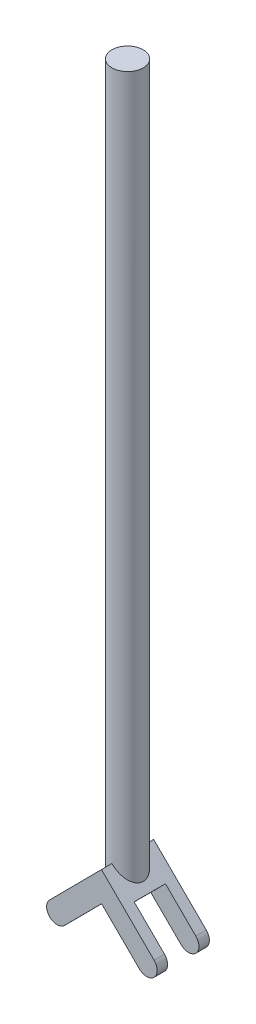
ISO-10303-21;
HEADER;
FILE_DESCRIPTION(('STEP AP214'),'2;1');
FILE_NAME('part.step','',(''),(''),'','','');
FILE_SCHEMA(('AUTOMOTIVE_DESIGN { 1 0 10303 214 1 1 1 1 }'));
ENDSEC;
DATA;
#1=APPLICATION_CONTEXT('core data for automotive mechanical design processes');
#2=APPLICATION_PROTOCOL_DEFINITION('international standard','automotive_design',2000,#1);
#3=PRODUCT_CONTEXT('',#1,'mechanical');
#4=PRODUCT('Part','Part','',(#3));
#5=PRODUCT_RELATED_PRODUCT_CATEGORY('part','',(#4));
#6=PRODUCT_DEFINITION_FORMATION('','',#4);
#7=PRODUCT_DEFINITION_CONTEXT('part definition',#1,'design');
#8=PRODUCT_DEFINITION('design','',#6,#7);
#9=PRODUCT_DEFINITION_SHAPE('','',#8);
#10=(LENGTH_UNIT() NAMED_UNIT(*) SI_UNIT(.MILLI.,.METRE.));
#11=(NAMED_UNIT(*) PLANE_ANGLE_UNIT() SI_UNIT($,.RADIAN.));
#12=(NAMED_UNIT(*) SI_UNIT($,.STERADIAN.) SOLID_ANGLE_UNIT());
#13=UNCERTAINTY_MEASURE_WITH_UNIT(LENGTH_MEASURE(1.E-05),#10,'distance_accuracy_value','');
#14=(GEOMETRIC_REPRESENTATION_CONTEXT(3) GLOBAL_UNCERTAINTY_ASSIGNED_CONTEXT((#13)) GLOBAL_UNIT_ASSIGNED_CONTEXT((#10,
#11,#12)) REPRESENTATION_CONTEXT('',''));
#15=CARTESIAN_POINT('',(0.,0.,0.));
#16=DIRECTION('',(0.,0.,1.));
#17=DIRECTION('',(1.,0.,0.));
#18=AXIS2_PLACEMENT_3D('',#15,#16,#17);
#19=CARTESIAN_POINT('',(27.5203997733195,-36.2563663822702,31.75));
#20=DIRECTION('',(0.,0.,-1.));
#21=DIRECTION('',(-1.,0.,0.));
#22=AXIS2_PLACEMENT_3D('',#19,#20,#21);
#23=CYLINDRICAL_SURFACE('',#22,6.35);
#24=DIRECTION('',(0.,0.,-1.));
#25=VECTOR('',#24,1.);
#26=CARTESIAN_POINT('',(23.0475080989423,-40.763664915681,31.75));
#27=LINE('',#26,#25);
#28=CARTESIAN_POINT('',(23.0475080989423,-40.763664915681,31.75));
#29=VERTEX_POINT('',#28);
#30=CARTESIAN_POINT('',(23.0475080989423,-40.763664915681,25.4));
#31=VERTEX_POINT('',#30);
#32=EDGE_CURVE('E217',#29,#31,#27,.T.);
#33=ORIENTED_EDGE('',*,*,#32,.T.);
#34=CARTESIAN_POINT('',(27.5203997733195,-36.2563663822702,25.4));
#35=DIRECTION('',(0.,0.,1.));
#36=DIRECTION('',(1.,0.,0.));
#37=AXIS2_PLACEMENT_3D('',#34,#35,#36);
#38=CIRCLE('',#37,6.35);
#39=CARTESIAN_POINT('',(31.9932914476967,-31.7490678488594,25.4));
#40=VERTEX_POINT('',#39);
#41=EDGE_CURVE('E239',#31,#40,#38,.T.);
#42=ORIENTED_EDGE('',*,*,#41,.T.);
#43=DIRECTION('',(0.,0.,-1.));
#44=VECTOR('',#43,1.);
#45=CARTESIAN_POINT('',(31.9932914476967,-31.7490678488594,31.75));
#46=LINE('',#45,#44);
#47=CARTESIAN_POINT('',(31.9932914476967,-31.7490678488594,31.75));
#48=VERTEX_POINT('',#47);
#49=EDGE_CURVE('E207',#48,#40,#46,.T.);
#50=ORIENTED_EDGE('',*,*,#49,.F.);
#51=CARTESIAN_POINT('',(27.5203997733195,-36.2563663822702,31.75));
#52=DIRECTION('',(0.,0.,1.));
#53=DIRECTION('',(1.,0.,0.));
#54=AXIS2_PLACEMENT_3D('',#51,#52,#53);
#55=CIRCLE('',#54,6.35);
#56=EDGE_CURVE('E208',#29,#48,#55,.T.);
#57=ORIENTED_EDGE('',*,*,#56,.F.);
#58=EDGE_LOOP('',(#33,#42,#50,#57));
#59=FACE_BOUND('',#58,.T.);
#60=ADVANCED_FACE('F33',(#59),#23,.T.);
#61=CARTESIAN_POINT('',(-26.9994100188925,-36.2219595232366,31.75));
#62=DIRECTION('',(0.,0.,-1.));
#63=DIRECTION('',(-1.,0.,0.));
#64=AXIS2_PLACEMENT_3D('',#61,#62,#63);
#65=CYLINDRICAL_SURFACE('',#64,6.35);
#66=CARTESIAN_POINT('',(-26.9994100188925,-36.2219595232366,6.35));
#67=DIRECTION('',(0.,0.,-1.));
#68=DIRECTION('',(0.,1.,0.));
#69=AXIS2_PLACEMENT_3D('',#66,#67,#68);
#70=CIRCLE('',#69,6.35);
#71=CARTESIAN_POINT('',(-22.4921114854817,-40.6948511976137,6.35));
#72=VERTEX_POINT('',#71);
#73=CARTESIAN_POINT('',(-31.5067085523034,-31.7490678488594,6.35));
#74=VERTEX_POINT('',#73);
#75=EDGE_CURVE('E276',#72,#74,#70,.T.);
#76=ORIENTED_EDGE('',*,*,#75,.T.);
#77=DIRECTION('',(0.,0.,-1.));
#78=VECTOR('',#77,1.);
#79=CARTESIAN_POINT('',(-31.5067085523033,-31.7490678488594,31.75));
#80=LINE('',#79,#78);
#81=CARTESIAN_POINT('',(-31.5067085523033,-31.7490678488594,0.));
#82=VERTEX_POINT('',#81);
#83=EDGE_CURVE('E226',#74,#82,#80,.T.);
#84=ORIENTED_EDGE('',*,*,#83,.T.);
#85=CARTESIAN_POINT('',(-26.9994100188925,-36.2219595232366,0.));
#86=DIRECTION('',(0.,0.,1.));
#87=DIRECTION('',(1.,0.,0.));
#88=AXIS2_PLACEMENT_3D('',#85,#86,#87);
#89=CIRCLE('',#88,6.35);
#90=CARTESIAN_POINT('',(-22.4921114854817,-40.6948511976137,0.));
#91=VERTEX_POINT('',#90);
#92=EDGE_CURVE('E291',#82,#91,#89,.T.);
#93=ORIENTED_EDGE('',*,*,#92,.T.);
#94=DIRECTION('',(0.,0.,-1.));
#95=VECTOR('',#94,1.);
#96=CARTESIAN_POINT('',(-22.4921114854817,-40.6948511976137,31.75));
#97=LINE('',#96,#95);
#98=EDGE_CURVE('E222',#72,#91,#97,.T.);
#99=ORIENTED_EDGE('',*,*,#98,.F.);
#100=EDGE_LOOP('',(#76,#84,#93,#99));
#101=FACE_BOUND('',#100,.T.);
#102=ADVANCED_FACE('F172',(#101),#65,.T.);
#103=CARTESIAN_POINT('',(31.9932914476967,-31.7490678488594,31.75));
#104=DIRECTION('',(-0.704392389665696,-0.709810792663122,0.));
#105=DIRECTION('',(0.709810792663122,-0.704392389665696,0.));
#106=AXIS2_PLACEMENT_3D('',#103,#104,#105);
#107=PLANE('',#106);
#108=CARTESIAN_POINT('',(0.,0.,15.875));
#109=DIRECTION('',(-0.704392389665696,-0.709810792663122,0.));
#110=DIRECTION('',(0.709810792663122,-0.704392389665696,0.));
#111=AXIS2_PLACEMENT_3D('',#108,#109,#110);
#112=ELLIPSE('',#111,13.4190689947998,9.525);
#113=CARTESIAN_POINT('',(0.,0.,25.4));
#114=VERTEX_POINT('',#113);
#115=CARTESIAN_POINT('',(0.,0.,6.35));
#116=VERTEX_POINT('',#115);
#117=EDGE_CURVE('E149',#114,#116,#112,.F.);
#118=ORIENTED_EDGE('',*,*,#117,.F.);
#119=DIRECTION('',(0.,0.,-1.));
#120=VECTOR('',#119,1.);
#121=CARTESIAN_POINT('',(0.,0.,31.75));
#122=LINE('',#121,#120);
#123=CARTESIAN_POINT('',(0.,0.,31.75));
#124=VERTEX_POINT('',#123);
#125=EDGE_CURVE('E137',#124,#114,#122,.T.);
#126=ORIENTED_EDGE('',*,*,#125,.F.);
#127=DIRECTION('',(-0.709810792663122,0.704392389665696,0.));
#128=VECTOR('',#127,1.);
#129=CARTESIAN_POINT('',(31.9932914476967,-31.7490678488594,31.75));
#130=LINE('',#129,#128);
#131=EDGE_CURVE('E279',#48,#124,#130,.T.);
#132=ORIENTED_EDGE('',*,*,#131,.F.);
#133=ORIENTED_EDGE('',*,*,#49,.T.);
#134=DIRECTION('',(0.709810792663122,-0.704392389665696,0.));
#135=VECTOR('',#134,1.);
#136=CARTESIAN_POINT('',(36.5005899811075,-36.2219595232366,25.4));
#137=LINE('',#136,#135);
#138=CARTESIAN_POINT('',(13.5218956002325,-13.4186750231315,25.4));
#139=VERTEX_POINT('',#138);
#140=EDGE_CURVE('E253',#139,#40,#137,.T.);
#141=ORIENTED_EDGE('',*,*,#140,.F.);
#142=DIRECTION('',(0.,0.,1.));
#143=VECTOR('',#142,1.);
#144=CARTESIAN_POINT('',(13.5218956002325,-13.4186750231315,6.35));
#145=LINE('',#144,#143);
#146=CARTESIAN_POINT('',(13.5218956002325,-13.4186750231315,6.35));
#147=VERTEX_POINT('',#146);
#148=EDGE_CURVE('E256',#147,#139,#145,.T.);
#149=ORIENTED_EDGE('',*,*,#148,.F.);
#150=DIRECTION('',(-0.709810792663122,0.704392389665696,0.));
#151=VECTOR('',#150,1.);
#152=CARTESIAN_POINT('',(36.5005899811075,-36.2219595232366,6.35));
#153=LINE('',#152,#151);
#154=CARTESIAN_POINT('',(31.9932914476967,-31.7490678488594,6.35));
#155=VERTEX_POINT('',#154);
#156=EDGE_CURVE('E152',#155,#147,#153,.T.);
#157=ORIENTED_EDGE('',*,*,#156,.F.);
#158=CARTESIAN_POINT('',(31.9932914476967,-31.7490678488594,0.));
#159=VERTEX_POINT('',#158);
#160=EDGE_CURVE('E200',#155,#159,#46,.T.);
#161=ORIENTED_EDGE('',*,*,#160,.T.);
#162=DIRECTION('',(-0.709810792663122,0.704392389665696,0.));
#163=VECTOR('',#162,1.);
#164=CARTESIAN_POINT('',(31.9932914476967,-31.7490678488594,0.));
#165=LINE('',#164,#163);
#166=CARTESIAN_POINT('',(0.,0.,0.));
#167=VERTEX_POINT('',#166);
#168=EDGE_CURVE('E278',#159,#167,#165,.T.);
#169=ORIENTED_EDGE('',*,*,#168,.T.);
#170=EDGE_CURVE('E146',#116,#167,#122,.T.);
#171=ORIENTED_EDGE('',*,*,#170,.F.);
#172=EDGE_LOOP('',(#118,#126,#132,#133,#141,#149,#157,#161,#169,#171));
#173=FACE_BOUND('',#172,.T.);
#174=ADVANCED_FACE('F35',(#173),#107,.F.);
#175=CARTESIAN_POINT('',(0.,0.,31.75));
#176=DIRECTION('',(0.709810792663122,-0.704392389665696,0.));
#177=DIRECTION('',(0.704392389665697,0.709810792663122,0.));
#178=AXIS2_PLACEMENT_3D('',#175,#176,#177);
#179=PLANE('',#178);
#180=CARTESIAN_POINT('',(0.,0.,15.875));
#181=DIRECTION('',(0.709810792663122,-0.704392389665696,0.));
#182=DIRECTION('',(-0.704392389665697,-0.709810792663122,0.));
#183=AXIS2_PLACEMENT_3D('',#180,#181,#182);
#184=ELLIPSE('',#183,13.5222926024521,9.525);
#185=EDGE_CURVE('E11',#116,#114,#184,.F.);
#186=ORIENTED_EDGE('',*,*,#185,.F.);
#187=ORIENTED_EDGE('',*,*,#170,.T.);
#188=DIRECTION('',(-0.704392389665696,-0.709810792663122,0.));
#189=VECTOR('',#188,1.);
#190=CARTESIAN_POINT('',(0.,0.,0.));
#191=LINE('',#190,#189);
#192=EDGE_CURVE('E288',#167,#82,#191,.T.);
#193=ORIENTED_EDGE('',*,*,#192,.T.);
#194=ORIENTED_EDGE('',*,*,#83,.F.);
#195=DIRECTION('',(-0.704392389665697,-0.709810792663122,0.));
#196=VECTOR('',#195,1.);
#197=CARTESIAN_POINT('',(-13.4186750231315,-13.5218956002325,6.35));
#198=LINE('',#197,#196);
#199=CARTESIAN_POINT('',(-13.4186750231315,-13.5218956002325,6.35));
#200=VERTEX_POINT('',#199);
#201=EDGE_CURVE('E261',#200,#74,#198,.T.);
#202=ORIENTED_EDGE('',*,*,#201,.F.);
#203=DIRECTION('',(0.,0.,-1.));
#204=VECTOR('',#203,1.);
#205=CARTESIAN_POINT('',(-13.4186750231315,-13.5218956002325,6.35));
#206=LINE('',#205,#204);
#207=CARTESIAN_POINT('',(-13.4186750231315,-13.5218956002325,25.4));
#208=VERTEX_POINT('',#207);
#209=EDGE_CURVE('E267',#208,#200,#206,.T.);
#210=ORIENTED_EDGE('',*,*,#209,.F.);
#211=DIRECTION('',(0.704392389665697,0.709810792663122,0.));
#212=VECTOR('',#211,1.);
#213=CARTESIAN_POINT('',(-13.4186750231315,-13.5218956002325,25.4));
#214=LINE('',#213,#212);
#215=CARTESIAN_POINT('',(-31.5067085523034,-31.7490678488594,25.4));
#216=VERTEX_POINT('',#215);
#217=EDGE_CURVE('E264',#216,#208,#214,.T.);
#218=ORIENTED_EDGE('',*,*,#217,.F.);
#219=CARTESIAN_POINT('',(-31.5067085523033,-31.7490678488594,31.75));
#220=VERTEX_POINT('',#219);
#221=EDGE_CURVE('E227',#220,#216,#80,.T.);
#222=ORIENTED_EDGE('',*,*,#221,.F.);
#223=DIRECTION('',(-0.704392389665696,-0.709810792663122,0.));
#224=VECTOR('',#223,1.);
#225=CARTESIAN_POINT('',(0.,0.,31.75));
#226=LINE('',#225,#224);
#227=EDGE_CURVE('E141',#124,#220,#226,.T.);
#228=ORIENTED_EDGE('',*,*,#227,.F.);
#229=ORIENTED_EDGE('',*,*,#125,.T.);
#230=EDGE_LOOP('',(#186,#187,#193,#194,#202,#210,#218,#222,#228,#229));
#231=FACE_BOUND('',#230,.T.);
#232=ADVANCED_FACE('F139',(#231),#179,.F.);
#233=ORIENTED_EDGE('',*,*,#221,.T.);
#234=CARTESIAN_POINT('',(-26.9994100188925,-36.2219595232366,25.4));
#235=DIRECTION('',(0.,0.,1.));
#236=DIRECTION('',(0.,-1.,0.));
#237=AXIS2_PLACEMENT_3D('',#234,#235,#236);
#238=CIRCLE('',#237,6.35);
#239=CARTESIAN_POINT('',(-22.4921114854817,-40.6948511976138,25.4));
#240=VERTEX_POINT('',#239);
#241=EDGE_CURVE('E273',#216,#240,#238,.T.);
#242=ORIENTED_EDGE('',*,*,#241,.T.);
#243=CARTESIAN_POINT('',(-22.4921114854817,-40.6948511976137,31.75));
#244=VERTEX_POINT('',#243);
#245=EDGE_CURVE('E223',#244,#240,#97,.T.);
#246=ORIENTED_EDGE('',*,*,#245,.F.);
#247=CARTESIAN_POINT('',(-26.9994100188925,-36.2219595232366,31.75));
#248=DIRECTION('',(0.,0.,1.));
#249=DIRECTION('',(1.,0.,0.));
#250=AXIS2_PLACEMENT_3D('',#247,#248,#249);
#251=CIRCLE('',#250,6.35);
#252=EDGE_CURVE('E282',#220,#244,#251,.T.);
#253=ORIENTED_EDGE('',*,*,#252,.F.);
#254=EDGE_LOOP('',(#233,#242,#246,#253));
#255=FACE_BOUND('',#254,.T.);
#256=ADVANCED_FACE('F181',(#255),#65,.T.);
#257=CARTESIAN_POINT('',(0.0688137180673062,-17.960380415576,31.75));
#258=DIRECTION('',(-0.709810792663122,0.704392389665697,0.));
#259=DIRECTION('',(-0.704392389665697,-0.709810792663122,0.));
#260=AXIS2_PLACEMENT_3D('',#257,#258,#259);
#261=PLANE('',#260);
#262=DIRECTION('',(0.,0.,-1.));
#263=VECTOR('',#262,1.);
#264=CARTESIAN_POINT('',(-4.40407795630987,-22.4676789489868,31.75));
#265=LINE('',#264,#263);
#266=CARTESIAN_POINT('',(-4.40407795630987,-22.4676789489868,25.4));
#267=VERTEX_POINT('',#266);
#268=CARTESIAN_POINT('',(-4.40407795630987,-22.4676789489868,6.35));
#269=VERTEX_POINT('',#268);
#270=EDGE_CURVE('E232',#267,#269,#265,.T.);
#271=ORIENTED_EDGE('',*,*,#270,.T.);
#272=DIRECTION('',(-0.704392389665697,-0.709810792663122,0.));
#273=VECTOR('',#272,1.);
#274=CARTESIAN_POINT('',(0.0688137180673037,-17.960380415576,6.35));
#275=LINE('',#274,#273);
#276=EDGE_CURVE('E235',#269,#72,#275,.T.);
#277=ORIENTED_EDGE('',*,*,#276,.T.);
#278=ORIENTED_EDGE('',*,*,#98,.T.);
#279=DIRECTION('',(0.704392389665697,0.709810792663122,0.));
#280=VECTOR('',#279,1.);
#281=CARTESIAN_POINT('',(0.0688137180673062,-17.960380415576,0.));
#282=LINE('',#281,#280);
#283=CARTESIAN_POINT('',(0.0688137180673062,-17.960380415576,0.));
#284=VERTEX_POINT('',#283);
#285=EDGE_CURVE('E294',#91,#284,#282,.T.);
#286=ORIENTED_EDGE('',*,*,#285,.T.);
#287=DIRECTION('',(0.,0.,-1.));
#288=VECTOR('',#287,1.);
#289=CARTESIAN_POINT('',(0.0688137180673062,-17.960380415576,31.75));
#290=LINE('',#289,#288);
#291=CARTESIAN_POINT('',(0.0688137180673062,-17.960380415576,31.75));
#292=VERTEX_POINT('',#291);
#293=EDGE_CURVE('E219',#292,#284,#290,.T.);
#294=ORIENTED_EDGE('',*,*,#293,.F.);
#295=DIRECTION('',(0.704392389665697,0.709810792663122,0.));
#296=VECTOR('',#295,1.);
#297=CARTESIAN_POINT('',(0.0688137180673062,-17.960380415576,31.75));
#298=LINE('',#297,#296);
#299=EDGE_CURVE('E284',#244,#292,#298,.T.);
#300=ORIENTED_EDGE('',*,*,#299,.F.);
#301=ORIENTED_EDGE('',*,*,#245,.T.);
#302=DIRECTION('',(0.704392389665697,0.709810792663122,0.));
#303=VECTOR('',#302,1.);
#304=CARTESIAN_POINT('',(0.0688137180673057,-17.960380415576,25.4));
#305=LINE('',#304,#303);
#306=EDGE_CURVE('E145',#240,#267,#305,.T.);
#307=ORIENTED_EDGE('',*,*,#306,.T.);
#308=EDGE_LOOP('',(#271,#277,#278,#286,#294,#300,#301,#307));
#309=FACE_BOUND('',#308,.T.);
#310=ADVANCED_FACE('F196',(#309),#261,.F.);
#311=CARTESIAN_POINT('',(23.0475080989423,-40.763664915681,31.75));
#312=DIRECTION('',(0.704392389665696,0.709810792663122,0.));
#313=DIRECTION('',(-0.709810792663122,0.704392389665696,0.));
#314=AXIS2_PLACEMENT_3D('',#311,#312,#313);
#315=PLANE('',#314);
#316=DIRECTION('',(0.,0.,1.));
#317=VECTOR('',#316,1.);
#318=CARTESIAN_POINT('',(4.57611225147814,-22.4332720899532,31.75));
#319=LINE('',#318,#317);
#320=CARTESIAN_POINT('',(4.57611225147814,-22.4332720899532,6.35));
#321=VERTEX_POINT('',#320);
#322=CARTESIAN_POINT('',(4.57611225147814,-22.4332720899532,25.4));
#323=VERTEX_POINT('',#322);
#324=EDGE_CURVE('E41',#321,#323,#319,.T.);
#325=ORIENTED_EDGE('',*,*,#324,.T.);
#326=DIRECTION('',(0.709810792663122,-0.704392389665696,0.));
#327=VECTOR('',#326,1.);
#328=CARTESIAN_POINT('',(23.0475080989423,-40.763664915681,25.4));
#329=LINE('',#328,#327);
#330=EDGE_CURVE('E244',#323,#31,#329,.T.);
#331=ORIENTED_EDGE('',*,*,#330,.T.);
#332=ORIENTED_EDGE('',*,*,#32,.F.);
#333=DIRECTION('',(0.709810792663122,-0.704392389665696,0.));
#334=VECTOR('',#333,1.);
#335=CARTESIAN_POINT('',(23.0475080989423,-40.763664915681,31.75));
#336=LINE('',#335,#334);
#337=EDGE_CURVE('E212',#292,#29,#336,.T.);
#338=ORIENTED_EDGE('',*,*,#337,.F.);
#339=ORIENTED_EDGE('',*,*,#293,.T.);
#340=DIRECTION('',(0.709810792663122,-0.704392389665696,0.));
#341=VECTOR('',#340,1.);
#342=CARTESIAN_POINT('',(23.0475080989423,-40.763664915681,0.));
#343=LINE('',#342,#341);
#344=CARTESIAN_POINT('',(23.0475080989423,-40.763664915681,0.));
#345=VERTEX_POINT('',#344);
#346=EDGE_CURVE('E295',#284,#345,#343,.T.);
#347=ORIENTED_EDGE('',*,*,#346,.T.);
#348=CARTESIAN_POINT('',(23.0475080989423,-40.763664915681,6.35));
#349=VERTEX_POINT('',#348);
#350=EDGE_CURVE('E211',#349,#345,#27,.T.);
#351=ORIENTED_EDGE('',*,*,#350,.F.);
#352=DIRECTION('',(-0.709810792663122,0.704392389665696,0.));
#353=VECTOR('',#352,1.);
#354=CARTESIAN_POINT('',(23.0475080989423,-40.763664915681,6.35));
#355=LINE('',#354,#353);
#356=EDGE_CURVE('E54',#349,#321,#355,.T.);
#357=ORIENTED_EDGE('',*,*,#356,.T.);
#358=EDGE_LOOP('',(#325,#331,#332,#338,#339,#347,#351,#357));
#359=FACE_BOUND('',#358,.T.);
#360=ADVANCED_FACE('F187',(#359),#315,.F.);
#361=ORIENTED_EDGE('',*,*,#160,.F.);
#362=CARTESIAN_POINT('',(27.5203997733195,-36.2563663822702,6.35));
#363=DIRECTION('',(0.,0.,-1.));
#364=DIRECTION('',(-1.,0.,0.));
#365=AXIS2_PLACEMENT_3D('',#362,#363,#364);
#366=CIRCLE('',#365,6.35);
#367=EDGE_CURVE('E201',#155,#349,#366,.T.);
#368=ORIENTED_EDGE('',*,*,#367,.T.);
#369=ORIENTED_EDGE('',*,*,#350,.T.);
#370=CARTESIAN_POINT('',(27.5203997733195,-36.2563663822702,0.));
#371=DIRECTION('',(0.,0.,1.));
#372=DIRECTION('',(1.,0.,0.));
#373=AXIS2_PLACEMENT_3D('',#370,#371,#372);
#374=CIRCLE('',#373,6.35);
#375=EDGE_CURVE('E204',#345,#159,#374,.T.);
#376=ORIENTED_EDGE('',*,*,#375,.T.);
#377=EDGE_LOOP('',(#361,#368,#369,#376));
#378=FACE_BOUND('',#377,.T.);
#379=ADVANCED_FACE('F175',(#378),#23,.T.);
#380=CARTESIAN_POINT('',(-26.9994100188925,-36.2219595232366,31.75));
#381=DIRECTION('',(0.,0.,1.));
#382=DIRECTION('',(1.,0.,0.));
#383=AXIS2_PLACEMENT_3D('',#380,#381,#382);
#384=PLANE('',#383);
#385=ORIENTED_EDGE('',*,*,#131,.T.);
#386=ORIENTED_EDGE('',*,*,#227,.T.);
#387=ORIENTED_EDGE('',*,*,#252,.T.);
#388=ORIENTED_EDGE('',*,*,#299,.T.);
#389=ORIENTED_EDGE('',*,*,#337,.T.);
#390=ORIENTED_EDGE('',*,*,#56,.T.);
#391=EDGE_LOOP('',(#385,#386,#387,#388,#389,#390));
#392=FACE_BOUND('',#391,.T.);
#393=ADVANCED_FACE('F186',(#392),#384,.T.);
#394=CARTESIAN_POINT('',(-26.9994100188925,-36.2219595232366,0.));
#395=DIRECTION('',(0.,0.,1.));
#396=DIRECTION('',(1.,0.,0.));
#397=AXIS2_PLACEMENT_3D('',#394,#395,#396);
#398=PLANE('',#397);
#399=ORIENTED_EDGE('',*,*,#168,.F.);
#400=ORIENTED_EDGE('',*,*,#375,.F.);
#401=ORIENTED_EDGE('',*,*,#346,.F.);
#402=ORIENTED_EDGE('',*,*,#285,.F.);
#403=ORIENTED_EDGE('',*,*,#92,.F.);
#404=ORIENTED_EDGE('',*,*,#192,.F.);
#405=EDGE_LOOP('',(#399,#400,#401,#402,#403,#404));
#406=FACE_BOUND('',#405,.T.);
#407=ADVANCED_FACE('F193',(#406),#398,.F.);
#408=CARTESIAN_POINT('',(24.9488523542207,-51.5965410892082,6.35));
#409=DIRECTION('',(0.,0.,-1.));
#410=DIRECTION('',(0.,1.,0.));
#411=AXIS2_PLACEMENT_3D('',#408,#409,#410);
#412=PLANE('',#411);
#413=ORIENTED_EDGE('',*,*,#75,.F.);
#414=ORIENTED_EDGE('',*,*,#276,.F.);
#415=DIRECTION('',(-0.709810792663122,0.704392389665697,0.));
#416=VECTOR('',#415,1.);
#417=CARTESIAN_POINT('',(24.9488523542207,-51.5965410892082,6.35));
#418=LINE('',#417,#416);
#419=EDGE_CURVE('E271',#269,#200,#418,.T.);
#420=ORIENTED_EDGE('',*,*,#419,.T.);
#421=ORIENTED_EDGE('',*,*,#201,.T.);
#422=EDGE_LOOP('',(#413,#414,#420,#421));
#423=FACE_BOUND('',#422,.T.);
#424=ADVANCED_FACE('F309',(#423),#412,.F.);
#425=CARTESIAN_POINT('',(24.9488523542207,-51.5965410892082,6.35));
#426=DIRECTION('',(0.704392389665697,0.709810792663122,0.));
#427=DIRECTION('',(-0.709810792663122,0.704392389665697,0.));
#428=AXIS2_PLACEMENT_3D('',#425,#426,#427);
#429=PLANE('',#428);
#430=DIRECTION('',(-0.709810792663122,0.704392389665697,0.));
#431=VECTOR('',#430,1.);
#432=CARTESIAN_POINT('',(24.9488523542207,-51.5965410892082,25.4));
#433=LINE('',#432,#431);
#434=EDGE_CURVE('E270',#267,#208,#433,.T.);
#435=ORIENTED_EDGE('',*,*,#434,.T.);
#436=ORIENTED_EDGE('',*,*,#209,.T.);
#437=ORIENTED_EDGE('',*,*,#419,.F.);
#438=ORIENTED_EDGE('',*,*,#270,.F.);
#439=EDGE_LOOP('',(#435,#436,#437,#438));
#440=FACE_BOUND('',#439,.T.);
#441=ADVANCED_FACE('F313',(#440),#429,.F.);
#442=CARTESIAN_POINT('',(24.9488523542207,-51.5965410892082,25.4));
#443=DIRECTION('',(0.,0.,1.));
#444=DIRECTION('',(0.,-1.,0.));
#445=AXIS2_PLACEMENT_3D('',#442,#443,#444);
#446=PLANE('',#445);
#447=ORIENTED_EDGE('',*,*,#217,.T.);
#448=ORIENTED_EDGE('',*,*,#434,.F.);
#449=ORIENTED_EDGE('',*,*,#306,.F.);
#450=ORIENTED_EDGE('',*,*,#241,.F.);
#451=EDGE_LOOP('',(#447,#448,#449,#450));
#452=FACE_BOUND('',#451,.T.);
#453=ADVANCED_FACE('F333',(#452),#446,.F.);
#454=CARTESIAN_POINT('',(-24.3275935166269,-51.5593140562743,6.35));
#455=DIRECTION('',(-0.709810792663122,0.704392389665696,0.));
#456=DIRECTION('',(-0.704392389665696,-0.709810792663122,0.));
#457=AXIS2_PLACEMENT_3D('',#454,#455,#456);
#458=PLANE('',#457);
#459=DIRECTION('',(0.704392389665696,0.709810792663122,0.));
#460=VECTOR('',#459,1.);
#461=CARTESIAN_POINT('',(-24.3275935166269,-51.5593140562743,6.35));
#462=LINE('',#461,#460);
#463=EDGE_CURVE('E249',#321,#147,#462,.T.);
#464=ORIENTED_EDGE('',*,*,#463,.T.);
#465=ORIENTED_EDGE('',*,*,#148,.T.);
#466=DIRECTION('',(0.704392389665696,0.709810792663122,0.));
#467=VECTOR('',#466,1.);
#468=CARTESIAN_POINT('',(-24.3275935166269,-51.5593140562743,25.4));
#469=LINE('',#468,#467);
#470=EDGE_CURVE('E251',#323,#139,#469,.T.);
#471=ORIENTED_EDGE('',*,*,#470,.F.);
#472=ORIENTED_EDGE('',*,*,#324,.F.);
#473=EDGE_LOOP('',(#464,#465,#471,#472));
#474=FACE_BOUND('',#473,.T.);
#475=ADVANCED_FACE('F247',(#474),#458,.F.);
#476=CARTESIAN_POINT('',(-1.34889913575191,-74.3625985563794,25.4));
#477=DIRECTION('',(0.,0.,1.));
#478=DIRECTION('',(1.,0.,0.));
#479=AXIS2_PLACEMENT_3D('',#476,#477,#478);
#480=PLANE('',#479);
#481=ORIENTED_EDGE('',*,*,#470,.T.);
#482=ORIENTED_EDGE('',*,*,#140,.T.);
#483=ORIENTED_EDGE('',*,*,#41,.F.);
#484=ORIENTED_EDGE('',*,*,#330,.F.);
#485=EDGE_LOOP('',(#481,#482,#483,#484));
#486=FACE_BOUND('',#485,.T.);
#487=ADVANCED_FACE('F167',(#486),#480,.F.);
#488=CARTESIAN_POINT('',(-1.34889913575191,-74.3625985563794,6.35));
#489=DIRECTION('',(0.,0.,-1.));
#490=DIRECTION('',(-1.,0.,0.));
#491=AXIS2_PLACEMENT_3D('',#488,#489,#490);
#492=PLANE('',#491);
#493=ORIENTED_EDGE('',*,*,#367,.F.);
#494=ORIENTED_EDGE('',*,*,#156,.T.);
#495=ORIENTED_EDGE('',*,*,#463,.F.);
#496=ORIENTED_EDGE('',*,*,#356,.F.);
#497=EDGE_LOOP('',(#493,#494,#495,#496));
#498=FACE_BOUND('',#497,.T.);
#499=ADVANCED_FACE('F158',(#498),#492,.F.);
#500=CARTESIAN_POINT('',(0.,419.1,15.875));
#501=DIRECTION('',(0.,-1.,0.));
#502=DIRECTION('',(0.,0.,-1.));
#503=AXIS2_PLACEMENT_3D('',#500,#501,#502);
#504=CYLINDRICAL_SURFACE('',#503,9.525);
#505=CARTESIAN_POINT('',(0.,419.1,15.875));
#506=DIRECTION('',(0.,1.,0.));
#507=DIRECTION('',(0.,0.,1.));
#508=AXIS2_PLACEMENT_3D('',#505,#506,#507);
#509=CIRCLE('',#508,9.525);
#510=CARTESIAN_POINT('',(0.,419.1,25.4));
#511=VERTEX_POINT('',#510);
#512=EDGE_CURVE('E153',#511,#511,#509,.T.);
#513=ORIENTED_EDGE('',*,*,#512,.F.);
#514=EDGE_LOOP('',(#513));
#515=FACE_BOUND('',#514,.T.);
#516=ORIENTED_EDGE('',*,*,#185,.T.);
#517=ORIENTED_EDGE('',*,*,#117,.T.);
#518=EDGE_LOOP('',(#516,#517));
#519=FACE_BOUND('',#518,.T.);
#520=ADVANCED_FACE('F155',(#515,#519),#504,.T.);
#521=CARTESIAN_POINT('',(0.,419.1,15.875));
#522=DIRECTION('',(0.,1.,0.));
#523=DIRECTION('',(0.,0.,1.));
#524=AXIS2_PLACEMENT_3D('',#521,#522,#523);
#525=PLANE('',#524);
#526=ORIENTED_EDGE('',*,*,#512,.T.);
#527=EDGE_LOOP('',(#526));
#528=FACE_BOUND('',#527,.T.);
#529=ADVANCED_FACE('F157',(#528),#525,.T.);
#530=CLOSED_SHELL('',(#60,#102,#174,#232,#256,#310,#360,#379,#393,#407,#424,#441,#453,#475,#487,
#499,#520,#529));
#531=MANIFOLD_SOLID_BREP('B2',#530);
#532=ADVANCED_BREP_SHAPE_REPRESENTATION('',(#18,#531),#14);
#533=SHAPE_DEFINITION_REPRESENTATION(#9,#532);
ENDSEC;
END-ISO-10303-21;
